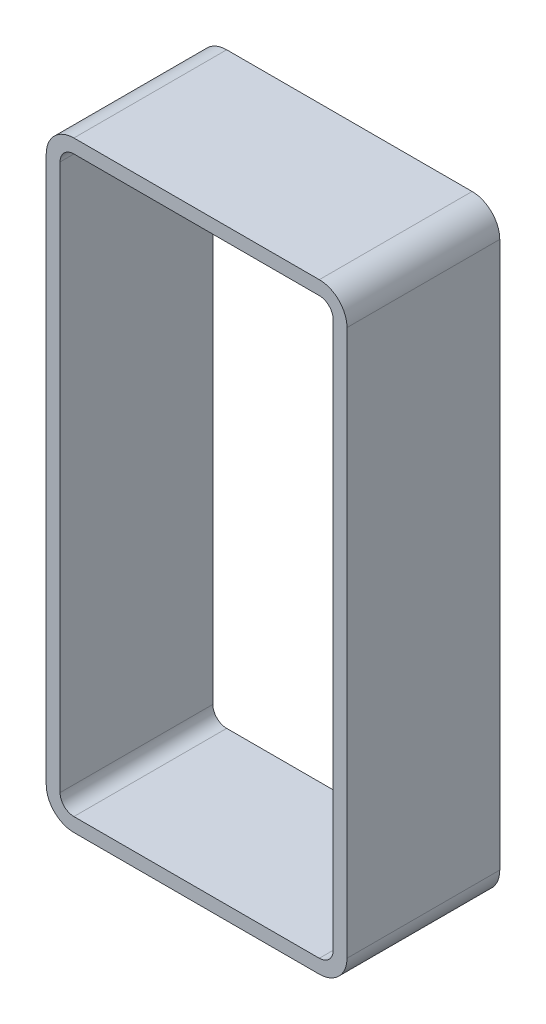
from build123d import *

# Parameters (mm, degrees)
BASESECTION_DEPTH = 12.7


with BuildPart() as part:
    # Sketch1 → BaseSection (new, symmetric)
    with BuildSketch(Plane.XY):
        with BuildLine():
            Line((-20.4, -50), (20.4, -50))
            ThreePointArc((20.4, -50), (23.652691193, -48.652691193), (25, -45.4))
            Line((25, -45.4), (25, 45.4))
            ThreePointArc((25, 45.4), (23.652691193, 48.652691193), (20.4, 50))
            Line((20.4, 50), (-20.4, 50))
            ThreePointArc((-20.4, 50), (-23.652691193, 48.652691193), (-25, 45.4))
            Line((-25, 45.4), (-25, -45.4))
            ThreePointArc((-25, -45.4), (-23.652691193, -48.652691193), (-20.4, -50))
        make_face()
        with BuildLine():
            Line((-20.4, 47.7), (20.4, 47.7))
            ThreePointArc((20.4, 47.7), (22.026345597, 47.026345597), (22.7, 45.4))
            Line((22.7, 45.4), (22.7, -45.4))
            ThreePointArc((22.7, -45.4), (22.026345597, -47.026345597), (20.4, -47.7))
            Line((20.4, -47.7), (-20.4, -47.7))
            ThreePointArc((-20.4, -47.7), (-22.026345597, -47.026345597), (-22.7, -45.4))
            Line((-22.7, -45.4), (-22.7, 45.4))
            ThreePointArc((-22.7, 45.4), (-22.026345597, 47.026345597), (-20.4, 47.7))
        make_face(mode=Mode.SUBTRACT)
    extrude(amount=BASESECTION_DEPTH, both=True)


solid = part.part
